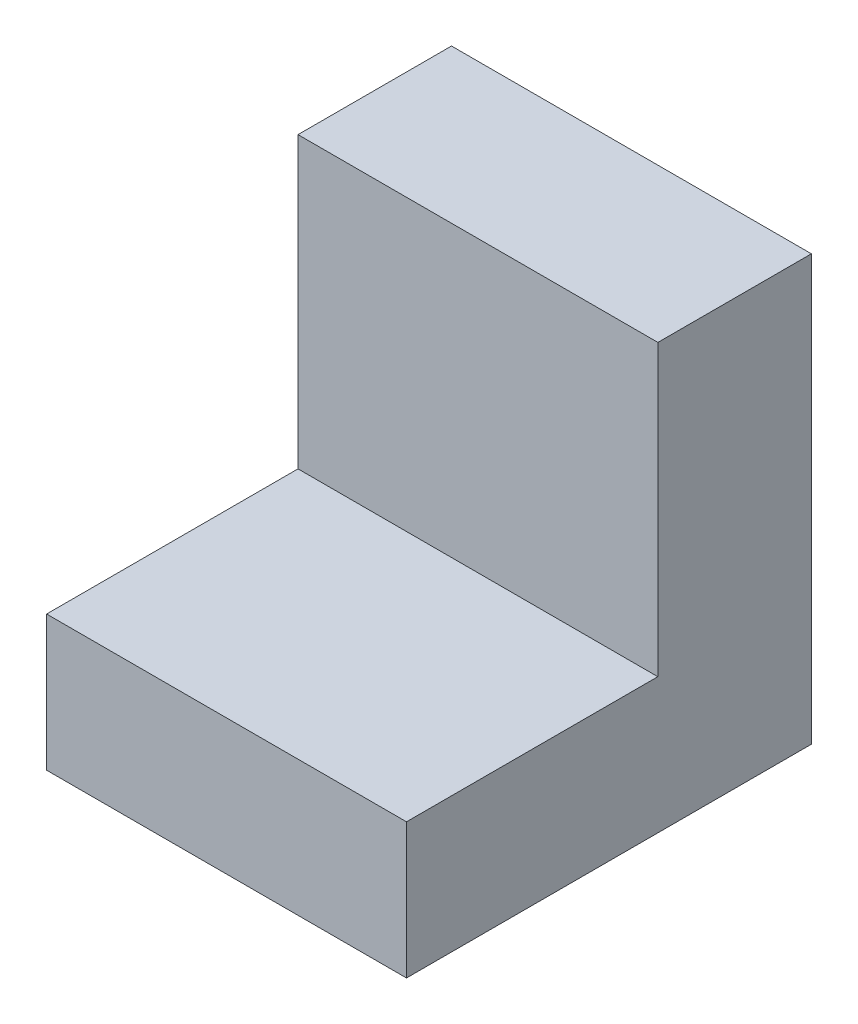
ISO-10303-21;
HEADER;
FILE_DESCRIPTION(('STEP AP214'),'2;1');
FILE_NAME('part.step','',(''),(''),'','','');
FILE_SCHEMA(('AUTOMOTIVE_DESIGN { 1 0 10303 214 1 1 1 1 }'));
ENDSEC;
DATA;
#1=APPLICATION_CONTEXT('core data for automotive mechanical design processes');
#2=APPLICATION_PROTOCOL_DEFINITION('international standard','automotive_design',2000,#1);
#3=PRODUCT_CONTEXT('',#1,'mechanical');
#4=PRODUCT('Part','Part','',(#3));
#5=PRODUCT_RELATED_PRODUCT_CATEGORY('part','',(#4));
#6=PRODUCT_DEFINITION_FORMATION('','',#4);
#7=PRODUCT_DEFINITION_CONTEXT('part definition',#1,'design');
#8=PRODUCT_DEFINITION('design','',#6,#7);
#9=PRODUCT_DEFINITION_SHAPE('','',#8);
#10=(LENGTH_UNIT() NAMED_UNIT(*) SI_UNIT(.MILLI.,.METRE.));
#11=(NAMED_UNIT(*) PLANE_ANGLE_UNIT() SI_UNIT($,.RADIAN.));
#12=(NAMED_UNIT(*) SI_UNIT($,.STERADIAN.) SOLID_ANGLE_UNIT());
#13=UNCERTAINTY_MEASURE_WITH_UNIT(LENGTH_MEASURE(1.E-05),#10,'distance_accuracy_value','');
#14=(GEOMETRIC_REPRESENTATION_CONTEXT(3) GLOBAL_UNCERTAINTY_ASSIGNED_CONTEXT((#13)) GLOBAL_UNIT_ASSIGNED_CONTEXT((#10,
#11,#12)) REPRESENTATION_CONTEXT('',''));
#15=CARTESIAN_POINT('',(0.,0.,0.));
#16=DIRECTION('',(0.,0.,1.));
#17=DIRECTION('',(1.,0.,0.));
#18=AXIS2_PLACEMENT_3D('',#15,#16,#17);
#19=CARTESIAN_POINT('',(116.586,43.8231034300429,0.));
#20=DIRECTION('',(0.,0.,-1.));
#21=DIRECTION('',(-1.,0.,0.));
#22=AXIS2_PLACEMENT_3D('',#19,#20,#21);
#23=PLANE('',#22);
#24=DIRECTION('',(0.,-1.,0.));
#25=VECTOR('',#24,1.);
#26=CARTESIAN_POINT('',(0.,43.8231034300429,0.));
#27=LINE('',#26,#25);
#28=CARTESIAN_POINT('',(0.,43.8231034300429,0.));
#29=VERTEX_POINT('',#28);
#30=CARTESIAN_POINT('',(0.,0.,0.));
#31=VERTEX_POINT('',#30);
#32=EDGE_CURVE('E146',#29,#31,#27,.T.);
#33=ORIENTED_EDGE('',*,*,#32,.T.);
#34=DIRECTION('',(-1.,0.,0.));
#35=VECTOR('',#34,1.);
#36=CARTESIAN_POINT('',(116.586,0.,0.));
#37=LINE('',#36,#35);
#38=CARTESIAN_POINT('',(116.586,0.,0.));
#39=VERTEX_POINT('',#38);
#40=EDGE_CURVE('E11',#39,#31,#37,.T.);
#41=ORIENTED_EDGE('',*,*,#40,.F.);
#42=DIRECTION('',(0.,-1.,0.));
#43=VECTOR('',#42,1.);
#44=CARTESIAN_POINT('',(116.586,43.8231034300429,0.));
#45=LINE('',#44,#43);
#46=CARTESIAN_POINT('',(116.586,43.8231034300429,0.));
#47=VERTEX_POINT('',#46);
#48=EDGE_CURVE('E153',#47,#39,#45,.T.);
#49=ORIENTED_EDGE('',*,*,#48,.F.);
#50=DIRECTION('',(-1.,0.,0.));
#51=VECTOR('',#50,1.);
#52=CARTESIAN_POINT('',(116.586,43.8231034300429,0.));
#53=LINE('',#52,#51);
#54=EDGE_CURVE('E119',#47,#29,#53,.T.);
#55=ORIENTED_EDGE('',*,*,#54,.T.);
#56=EDGE_LOOP('',(#33,#41,#49,#55));
#57=FACE_BOUND('',#56,.T.);
#58=ADVANCED_FACE('F31',(#57),#23,.F.);
#59=CARTESIAN_POINT('',(116.586,0.,0.));
#60=DIRECTION('',(0.,1.,0.));
#61=DIRECTION('',(0.,0.,1.));
#62=AXIS2_PLACEMENT_3D('',#59,#60,#61);
#63=PLANE('',#62);
#64=DIRECTION('',(0.,0.,-1.));
#65=VECTOR('',#64,1.);
#66=CARTESIAN_POINT('',(0.,0.,0.));
#67=LINE('',#66,#65);
#68=CARTESIAN_POINT('',(0.,0.,-131.163465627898));
#69=VERTEX_POINT('',#68);
#70=EDGE_CURVE('E142',#31,#69,#67,.T.);
#71=ORIENTED_EDGE('',*,*,#70,.T.);
#72=DIRECTION('',(-1.,0.,0.));
#73=VECTOR('',#72,1.);
#74=CARTESIAN_POINT('',(116.586,0.,-131.163465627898));
#75=LINE('',#74,#73);
#76=CARTESIAN_POINT('',(116.586,0.,-131.163465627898));
#77=VERTEX_POINT('',#76);
#78=EDGE_CURVE('E38',#77,#69,#75,.T.);
#79=ORIENTED_EDGE('',*,*,#78,.F.);
#80=DIRECTION('',(0.,0.,-1.));
#81=VECTOR('',#80,1.);
#82=CARTESIAN_POINT('',(116.586,0.,0.));
#83=LINE('',#82,#81);
#84=EDGE_CURVE('E155',#39,#77,#83,.T.);
#85=ORIENTED_EDGE('',*,*,#84,.F.);
#86=ORIENTED_EDGE('',*,*,#40,.T.);
#87=EDGE_LOOP('',(#71,#79,#85,#86));
#88=FACE_BOUND('',#87,.T.);
#89=ADVANCED_FACE('F175',(#88),#63,.F.);
#90=CARTESIAN_POINT('',(116.586,0.,-131.163465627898));
#91=DIRECTION('',(0.,0.,1.));
#92=DIRECTION('',(1.,0.,0.));
#93=AXIS2_PLACEMENT_3D('',#90,#91,#92);
#94=PLANE('',#93);
#95=DIRECTION('',(0.,1.,0.));
#96=VECTOR('',#95,1.);
#97=CARTESIAN_POINT('',(0.,0.,-131.163465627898));
#98=LINE('',#97,#96);
#99=CARTESIAN_POINT('',(0.,137.592655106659,-131.163465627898));
#100=VERTEX_POINT('',#99);
#101=EDGE_CURVE('E135',#69,#100,#98,.T.);
#102=ORIENTED_EDGE('',*,*,#101,.T.);
#103=DIRECTION('',(-1.,0.,0.));
#104=VECTOR('',#103,1.);
#105=CARTESIAN_POINT('',(116.586,137.592655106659,-131.163465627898));
#106=LINE('',#105,#104);
#107=CARTESIAN_POINT('',(116.586,137.592655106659,-131.163465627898));
#108=VERTEX_POINT('',#107);
#109=EDGE_CURVE('E121',#108,#100,#106,.T.);
#110=ORIENTED_EDGE('',*,*,#109,.F.);
#111=DIRECTION('',(0.,1.,0.));
#112=VECTOR('',#111,1.);
#113=CARTESIAN_POINT('',(116.586,0.,-131.163465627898));
#114=LINE('',#113,#112);
#115=EDGE_CURVE('E136',#77,#108,#114,.T.);
#116=ORIENTED_EDGE('',*,*,#115,.F.);
#117=ORIENTED_EDGE('',*,*,#78,.T.);
#118=EDGE_LOOP('',(#102,#110,#116,#117));
#119=FACE_BOUND('',#118,.T.);
#120=ADVANCED_FACE('F133',(#119),#94,.F.);
#121=CARTESIAN_POINT('',(116.586,137.592655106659,-131.163465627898));
#122=DIRECTION('',(0.,-1.,0.));
#123=DIRECTION('',(0.,0.,-1.));
#124=AXIS2_PLACEMENT_3D('',#121,#122,#123);
#125=PLANE('',#124);
#126=DIRECTION('',(0.,0.,1.));
#127=VECTOR('',#126,1.);
#128=CARTESIAN_POINT('',(0.,137.592655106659,-131.163465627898));
#129=LINE('',#128,#127);
#130=CARTESIAN_POINT('',(0.,137.592655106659,-81.4377606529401));
#131=VERTEX_POINT('',#130);
#132=EDGE_CURVE('E143',#100,#131,#129,.T.);
#133=ORIENTED_EDGE('',*,*,#132,.T.);
#134=DIRECTION('',(-1.,0.,0.));
#135=VECTOR('',#134,1.);
#136=CARTESIAN_POINT('',(116.586,137.592655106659,-81.4377606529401));
#137=LINE('',#136,#135);
#138=CARTESIAN_POINT('',(116.586,137.592655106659,-81.4377606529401));
#139=VERTEX_POINT('',#138);
#140=EDGE_CURVE('E118',#139,#131,#137,.T.);
#141=ORIENTED_EDGE('',*,*,#140,.F.);
#142=DIRECTION('',(0.,0.,1.));
#143=VECTOR('',#142,1.);
#144=CARTESIAN_POINT('',(116.586,137.592655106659,-131.163465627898));
#145=LINE('',#144,#143);
#146=EDGE_CURVE('E158',#108,#139,#145,.T.);
#147=ORIENTED_EDGE('',*,*,#146,.F.);
#148=ORIENTED_EDGE('',*,*,#109,.T.);
#149=EDGE_LOOP('',(#133,#141,#147,#148));
#150=FACE_BOUND('',#149,.T.);
#151=ADVANCED_FACE('F181',(#150),#125,.F.);
#152=CARTESIAN_POINT('',(116.586,137.592655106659,-81.4377606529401));
#153=DIRECTION('',(0.,0.,-1.));
#154=DIRECTION('',(-1.,0.,0.));
#155=AXIS2_PLACEMENT_3D('',#152,#153,#154);
#156=PLANE('',#155);
#157=DIRECTION('',(0.,-1.,0.));
#158=VECTOR('',#157,1.);
#159=CARTESIAN_POINT('',(0.,137.592655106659,-81.4377606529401));
#160=LINE('',#159,#158);
#161=CARTESIAN_POINT('',(0.,43.8231034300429,-81.4377606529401));
#162=VERTEX_POINT('',#161);
#163=EDGE_CURVE('E116',#131,#162,#160,.T.);
#164=ORIENTED_EDGE('',*,*,#163,.T.);
#165=DIRECTION('',(-1.,0.,0.));
#166=VECTOR('',#165,1.);
#167=CARTESIAN_POINT('',(116.586,43.8231034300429,-81.4377606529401));
#168=LINE('',#167,#166);
#169=CARTESIAN_POINT('',(5.3252951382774,43.8231034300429,-81.4377606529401));
#170=VERTEX_POINT('',#169);
#171=EDGE_CURVE('E109',#170,#162,#168,.T.);
#172=ORIENTED_EDGE('',*,*,#171,.F.);
#173=DIRECTION('',(0.,1.,0.));
#174=VECTOR('',#173,1.);
#175=CARTESIAN_POINT('',(5.3252951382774,28.837103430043,-81.4377606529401));
#176=LINE('',#175,#174);
#177=CARTESIAN_POINT('',(5.3252951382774,28.837103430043,-81.4377606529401));
#178=VERTEX_POINT('',#177);
#179=EDGE_CURVE('E97',#178,#170,#176,.T.);
#180=ORIENTED_EDGE('',*,*,#179,.F.);
#181=DIRECTION('',(-1.,0.,0.));
#182=VECTOR('',#181,1.);
#183=CARTESIAN_POINT('',(116.586,28.837103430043,-81.4377606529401));
#184=LINE('',#183,#182);
#185=CARTESIAN_POINT('',(116.586,28.837103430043,-81.4377606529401));
#186=VERTEX_POINT('',#185);
#187=EDGE_CURVE('E111',#186,#178,#184,.T.);
#188=ORIENTED_EDGE('',*,*,#187,.F.);
#189=DIRECTION('',(0.,-1.,0.));
#190=VECTOR('',#189,1.);
#191=CARTESIAN_POINT('',(116.586,137.592655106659,-81.4377606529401));
#192=LINE('',#191,#190);
#193=EDGE_CURVE('E160',#139,#186,#192,.T.);
#194=ORIENTED_EDGE('',*,*,#193,.F.);
#195=ORIENTED_EDGE('',*,*,#140,.T.);
#196=EDGE_LOOP('',(#164,#172,#180,#188,#194,#195));
#197=FACE_BOUND('',#196,.T.);
#198=ADVANCED_FACE('F113',(#197),#156,.F.);
#199=CARTESIAN_POINT('',(116.586,43.8231034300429,-81.4377606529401));
#200=DIRECTION('',(0.,-1.,0.));
#201=DIRECTION('',(0.,0.,-1.));
#202=AXIS2_PLACEMENT_3D('',#199,#200,#201);
#203=PLANE('',#202);
#204=DIRECTION('',(0.,0.,1.));
#205=VECTOR('',#204,1.);
#206=CARTESIAN_POINT('',(116.586,43.8231034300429,-81.4377606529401));
#207=LINE('',#206,#205);
#208=CARTESIAN_POINT('',(116.586,43.8231034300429,-81.4123606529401));
#209=VERTEX_POINT('',#208);
#210=EDGE_CURVE('E53',#209,#47,#207,.T.);
#211=ORIENTED_EDGE('',*,*,#210,.F.);
#212=DIRECTION('',(0.999999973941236,0.,0.000228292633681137));
#213=VECTOR('',#212,1.);
#214=CARTESIAN_POINT('',(5.3252951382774,43.8231034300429,-81.4377606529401));
#215=LINE('',#214,#213);
#216=EDGE_CURVE('E100',#170,#209,#215,.T.);
#217=ORIENTED_EDGE('',*,*,#216,.F.);
#218=ORIENTED_EDGE('',*,*,#171,.T.);
#219=DIRECTION('',(0.,0.,1.));
#220=VECTOR('',#219,1.);
#221=CARTESIAN_POINT('',(0.,43.8231034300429,-81.4377606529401));
#222=LINE('',#221,#220);
#223=EDGE_CURVE('E151',#162,#29,#222,.T.);
#224=ORIENTED_EDGE('',*,*,#223,.T.);
#225=ORIENTED_EDGE('',*,*,#54,.F.);
#226=EDGE_LOOP('',(#211,#217,#218,#224,#225));
#227=FACE_BOUND('',#226,.T.);
#228=ADVANCED_FACE('F108',(#227),#203,.F.);
#229=CARTESIAN_POINT('',(116.586,0.,0.));
#230=DIRECTION('',(1.,0.,0.));
#231=DIRECTION('',(0.,0.,-1.));
#232=AXIS2_PLACEMENT_3D('',#229,#230,#231);
#233=PLANE('',#232);
#234=ORIENTED_EDGE('',*,*,#193,.T.);
#235=DIRECTION('',(0.,0.,-1.));
#236=VECTOR('',#235,1.);
#237=CARTESIAN_POINT('',(116.586,28.837103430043,-81.4123606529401));
#238=LINE('',#237,#236);
#239=CARTESIAN_POINT('',(116.586,28.837103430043,-81.4123606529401));
#240=VERTEX_POINT('',#239);
#241=EDGE_CURVE('E105',#240,#186,#238,.T.);
#242=ORIENTED_EDGE('',*,*,#241,.F.);
#243=DIRECTION('',(0.,1.,0.));
#244=VECTOR('',#243,1.);
#245=CARTESIAN_POINT('',(116.586,28.837103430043,-81.4123606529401));
#246=LINE('',#245,#244);
#247=EDGE_CURVE('E104',#240,#209,#246,.T.);
#248=ORIENTED_EDGE('',*,*,#247,.T.);
#249=ORIENTED_EDGE('',*,*,#210,.T.);
#250=ORIENTED_EDGE('',*,*,#48,.T.);
#251=ORIENTED_EDGE('',*,*,#84,.T.);
#252=ORIENTED_EDGE('',*,*,#115,.T.);
#253=ORIENTED_EDGE('',*,*,#146,.T.);
#254=EDGE_LOOP('',(#234,#242,#248,#249,#250,#251,#252,#253));
#255=FACE_BOUND('',#254,.T.);
#256=ADVANCED_FACE('F163',(#255),#233,.T.);
#257=CARTESIAN_POINT('',(0.,0.,0.));
#258=DIRECTION('',(1.,0.,0.));
#259=DIRECTION('',(0.,0.,-1.));
#260=AXIS2_PLACEMENT_3D('',#257,#258,#259);
#261=PLANE('',#260);
#262=ORIENTED_EDGE('',*,*,#32,.F.);
#263=ORIENTED_EDGE('',*,*,#223,.F.);
#264=ORIENTED_EDGE('',*,*,#163,.F.);
#265=ORIENTED_EDGE('',*,*,#132,.F.);
#266=ORIENTED_EDGE('',*,*,#101,.F.);
#267=ORIENTED_EDGE('',*,*,#70,.F.);
#268=EDGE_LOOP('',(#262,#263,#264,#265,#266,#267));
#269=FACE_BOUND('',#268,.T.);
#270=ADVANCED_FACE('F141',(#269),#261,.F.);
#271=CARTESIAN_POINT('',(5.3252951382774,28.837103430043,-81.4377606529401));
#272=DIRECTION('',(-0.000228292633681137,0.,0.999999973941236));
#273=DIRECTION('',(0.999999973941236,0.,0.000228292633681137));
#274=AXIS2_PLACEMENT_3D('',#271,#272,#273);
#275=PLANE('',#274);
#276=ORIENTED_EDGE('',*,*,#216,.T.);
#277=ORIENTED_EDGE('',*,*,#247,.F.);
#278=DIRECTION('',(0.999999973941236,0.,0.000228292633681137));
#279=VECTOR('',#278,1.);
#280=CARTESIAN_POINT('',(5.3252951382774,28.837103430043,-81.4377606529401));
#281=LINE('',#280,#279);
#282=EDGE_CURVE('E45',#178,#240,#281,.T.);
#283=ORIENTED_EDGE('',*,*,#282,.F.);
#284=ORIENTED_EDGE('',*,*,#179,.T.);
#285=EDGE_LOOP('',(#276,#277,#283,#284));
#286=FACE_BOUND('',#285,.T.);
#287=ADVANCED_FACE('F99',(#286),#275,.F.);
#288=CARTESIAN_POINT('',(116.586,28.837103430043,-81.4377606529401));
#289=DIRECTION('',(0.,-1.,0.));
#290=DIRECTION('',(0.,0.,-1.));
#291=AXIS2_PLACEMENT_3D('',#288,#289,#290);
#292=PLANE('',#291);
#293=ORIENTED_EDGE('',*,*,#187,.T.);
#294=ORIENTED_EDGE('',*,*,#282,.T.);
#295=ORIENTED_EDGE('',*,*,#241,.T.);
#296=EDGE_LOOP('',(#293,#294,#295));
#297=FACE_BOUND('',#296,.T.);
#298=ADVANCED_FACE('F167',(#297),#292,.F.);
#299=CLOSED_SHELL('',(#58,#89,#120,#151,#198,#228,#256,#270,#287,#298));
#300=MANIFOLD_SOLID_BREP('B2',#299);
#301=ADVANCED_BREP_SHAPE_REPRESENTATION('',(#18,#300),#14);
#302=SHAPE_DEFINITION_REPRESENTATION(#9,#301);
ENDSEC;
END-ISO-10303-21;
